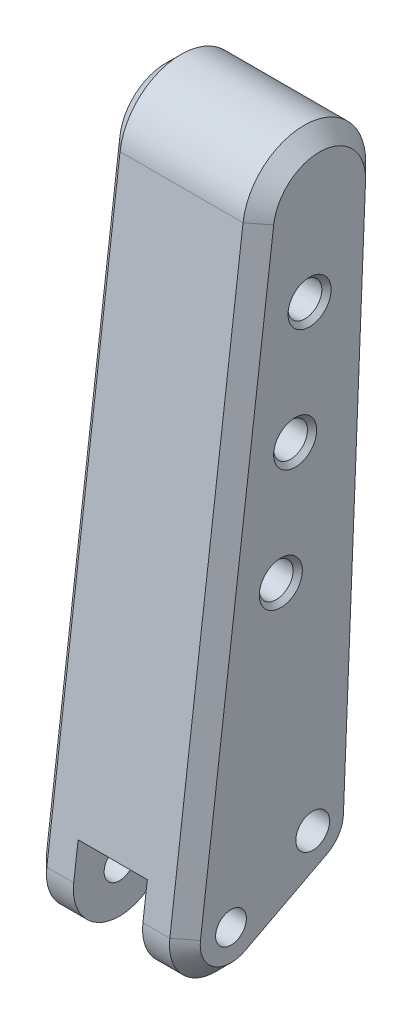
ISO-10303-21;
HEADER;
FILE_DESCRIPTION(('STEP AP214'),'2;1');
FILE_NAME('part.step','',(''),(''),'','','');
FILE_SCHEMA(('AUTOMOTIVE_DESIGN { 1 0 10303 214 1 1 1 1 }'));
ENDSEC;
DATA;
#1=APPLICATION_CONTEXT('core data for automotive mechanical design processes');
#2=APPLICATION_PROTOCOL_DEFINITION('international standard','automotive_design',2000,#1);
#3=PRODUCT_CONTEXT('',#1,'mechanical');
#4=PRODUCT('Part','Part','',(#3));
#5=PRODUCT_RELATED_PRODUCT_CATEGORY('part','',(#4));
#6=PRODUCT_DEFINITION_FORMATION('','',#4);
#7=PRODUCT_DEFINITION_CONTEXT('part definition',#1,'design');
#8=PRODUCT_DEFINITION('design','',#6,#7);
#9=PRODUCT_DEFINITION_SHAPE('','',#8);
#10=(LENGTH_UNIT() NAMED_UNIT(*) SI_UNIT(.MILLI.,.METRE.));
#11=(NAMED_UNIT(*) PLANE_ANGLE_UNIT() SI_UNIT($,.RADIAN.));
#12=(NAMED_UNIT(*) SI_UNIT($,.STERADIAN.) SOLID_ANGLE_UNIT());
#13=UNCERTAINTY_MEASURE_WITH_UNIT(LENGTH_MEASURE(1.E-05),#10,'distance_accuracy_value','');
#14=(GEOMETRIC_REPRESENTATION_CONTEXT(3) GLOBAL_UNCERTAINTY_ASSIGNED_CONTEXT((#13)) GLOBAL_UNIT_ASSIGNED_CONTEXT((#10,
#11,#12)) REPRESENTATION_CONTEXT('',''));
#15=CARTESIAN_POINT('',(0.,0.,0.));
#16=DIRECTION('',(0.,0.,1.));
#17=DIRECTION('',(1.,0.,0.));
#18=AXIS2_PLACEMENT_3D('',#15,#16,#17);
#19=CARTESIAN_POINT('',(-5.,81.8831087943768,0.204953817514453));
#20=DIRECTION('',(-1.,0.,0.));
#21=DIRECTION('',(0.,0.,1.));
#22=AXIS2_PLACEMENT_3D('',#19,#20,#21);
#23=CONICAL_SURFACE('',#22,1.4,0.78539816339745);
#24=CARTESIAN_POINT('',(-5.,81.8831087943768,0.204953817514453));
#25=DIRECTION('',(1.,0.,0.));
#26=DIRECTION('',(0.,0.,-1.));
#27=AXIS2_PLACEMENT_3D('',#24,#25,#26);
#28=CIRCLE('',#27,1.4);
#29=CARTESIAN_POINT('',(-5.,81.8831087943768,-1.19504618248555));
#30=VERTEX_POINT('',#29);
#31=EDGE_CURVE('E154',#30,#30,#28,.T.);
#32=ORIENTED_EDGE('',*,*,#31,.F.);
#33=EDGE_LOOP('',(#32));
#34=FACE_BOUND('',#33,.T.);
#35=CARTESIAN_POINT('',(-4.7,81.8831087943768,0.204953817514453));
#36=DIRECTION('',(-1.,0.,0.));
#37=DIRECTION('',(0.,0.,-1.));
#38=AXIS2_PLACEMENT_3D('',#35,#36,#37);
#39=CIRCLE('',#38,1.1);
#40=CARTESIAN_POINT('',(-4.7,81.8831087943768,-0.895046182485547));
#41=VERTEX_POINT('',#40);
#42=EDGE_CURVE('E11',#41,#41,#39,.T.);
#43=ORIENTED_EDGE('',*,*,#42,.F.);
#44=EDGE_LOOP('',(#43));
#45=FACE_BOUND('',#44,.T.);
#46=ADVANCED_FACE('F16',(#34,#45),#23,.F.);
#47=CARTESIAN_POINT('',(-5.,67.,2.07393017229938));
#48=DIRECTION('',(-1.,0.,0.));
#49=DIRECTION('',(0.,0.,1.));
#50=AXIS2_PLACEMENT_3D('',#47,#48,#49);
#51=CONICAL_SURFACE('',#50,1.4,0.78539816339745);
#52=CARTESIAN_POINT('',(-5.,67.,2.07393017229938));
#53=DIRECTION('',(1.,0.,0.));
#54=DIRECTION('',(0.,0.,-1.));
#55=AXIS2_PLACEMENT_3D('',#52,#53,#54);
#56=CIRCLE('',#55,1.4);
#57=CARTESIAN_POINT('',(-5.,67.,0.673930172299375));
#58=VERTEX_POINT('',#57);
#59=EDGE_CURVE('E159',#58,#58,#56,.T.);
#60=ORIENTED_EDGE('',*,*,#59,.F.);
#61=EDGE_LOOP('',(#60));
#62=FACE_BOUND('',#61,.T.);
#63=CARTESIAN_POINT('',(-4.7,67.,2.07393017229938));
#64=DIRECTION('',(-1.,0.,0.));
#65=DIRECTION('',(0.,0.,-1.));
#66=AXIS2_PLACEMENT_3D('',#63,#64,#65);
#67=CIRCLE('',#66,1.1);
#68=CARTESIAN_POINT('',(-4.7,67.,0.973930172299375));
#69=VERTEX_POINT('',#68);
#70=EDGE_CURVE('E83',#69,#69,#67,.T.);
#71=ORIENTED_EDGE('',*,*,#70,.F.);
#72=EDGE_LOOP('',(#71));
#73=FACE_BOUND('',#72,.T.);
#74=ADVANCED_FACE('F614',(#62,#73),#51,.F.);
#75=CARTESIAN_POINT('',(-5.,74.4415543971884,1.13944199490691));
#76=DIRECTION('',(-1.,0.,0.));
#77=DIRECTION('',(0.,0.,1.));
#78=AXIS2_PLACEMENT_3D('',#75,#76,#77);
#79=CONICAL_SURFACE('',#78,1.4,0.78539816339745);
#80=CARTESIAN_POINT('',(-5.,74.4415543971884,1.13944199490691));
#81=DIRECTION('',(1.,0.,0.));
#82=DIRECTION('',(0.,0.,-1.));
#83=AXIS2_PLACEMENT_3D('',#80,#81,#82);
#84=CIRCLE('',#83,1.4);
#85=CARTESIAN_POINT('',(-5.,74.4415543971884,-0.260558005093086));
#86=VERTEX_POINT('',#85);
#87=EDGE_CURVE('E171',#86,#86,#84,.T.);
#88=ORIENTED_EDGE('',*,*,#87,.F.);
#89=EDGE_LOOP('',(#88));
#90=FACE_BOUND('',#89,.T.);
#91=CARTESIAN_POINT('',(-4.7,74.4415543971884,1.13944199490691));
#92=DIRECTION('',(-1.,0.,0.));
#93=DIRECTION('',(0.,0.,-1.));
#94=AXIS2_PLACEMENT_3D('',#91,#92,#93);
#95=CIRCLE('',#94,1.1);
#96=CARTESIAN_POINT('',(-4.7,74.4415543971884,0.0394419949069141));
#97=VERTEX_POINT('',#96);
#98=EDGE_CURVE('E84',#97,#97,#95,.T.);
#99=ORIENTED_EDGE('',*,*,#98,.F.);
#100=EDGE_LOOP('',(#99));
#101=FACE_BOUND('',#100,.T.);
#102=ADVANCED_FACE('F619',(#90,#101),#79,.F.);
#103=CARTESIAN_POINT('',(5.,81.8831087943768,0.204953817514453));
#104=DIRECTION('',(1.,0.,0.));
#105=DIRECTION('',(0.,0.,-1.));
#106=AXIS2_PLACEMENT_3D('',#103,#104,#105);
#107=CONICAL_SURFACE('',#106,1.4,0.785398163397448);
#108=CARTESIAN_POINT('',(5.,81.8831087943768,0.204953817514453));
#109=DIRECTION('',(-1.,0.,0.));
#110=DIRECTION('',(0.,0.,-1.));
#111=AXIS2_PLACEMENT_3D('',#108,#109,#110);
#112=CIRCLE('',#111,1.4);
#113=CARTESIAN_POINT('',(5.,81.8831087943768,-1.19504618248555));
#114=VERTEX_POINT('',#113);
#115=EDGE_CURVE('E139',#114,#114,#112,.T.);
#116=ORIENTED_EDGE('',*,*,#115,.F.);
#117=EDGE_LOOP('',(#116));
#118=FACE_BOUND('',#117,.T.);
#119=CARTESIAN_POINT('',(4.7,81.8831087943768,0.204953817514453));
#120=DIRECTION('',(1.,0.,0.));
#121=DIRECTION('',(0.,0.,-1.));
#122=AXIS2_PLACEMENT_3D('',#119,#120,#121);
#123=CIRCLE('',#122,1.1);
#124=CARTESIAN_POINT('',(4.7,81.8831087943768,-0.895046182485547));
#125=VERTEX_POINT('',#124);
#126=EDGE_CURVE('E24',#125,#125,#123,.T.);
#127=ORIENTED_EDGE('',*,*,#126,.F.);
#128=EDGE_LOOP('',(#127));
#129=FACE_BOUND('',#128,.T.);
#130=ADVANCED_FACE('F624',(#118,#129),#107,.F.);
#131=CARTESIAN_POINT('',(5.,67.,2.07393017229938));
#132=DIRECTION('',(1.,0.,0.));
#133=DIRECTION('',(0.,0.,-1.));
#134=AXIS2_PLACEMENT_3D('',#131,#132,#133);
#135=CONICAL_SURFACE('',#134,1.4,0.785398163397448);
#136=CARTESIAN_POINT('',(5.,67.,2.07393017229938));
#137=DIRECTION('',(-1.,0.,0.));
#138=DIRECTION('',(0.,0.,-1.));
#139=AXIS2_PLACEMENT_3D('',#136,#137,#138);
#140=CIRCLE('',#139,1.4);
#141=CARTESIAN_POINT('',(5.,67.,0.673930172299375));
#142=VERTEX_POINT('',#141);
#143=EDGE_CURVE('E135',#142,#142,#140,.T.);
#144=ORIENTED_EDGE('',*,*,#143,.F.);
#145=EDGE_LOOP('',(#144));
#146=FACE_BOUND('',#145,.T.);
#147=CARTESIAN_POINT('',(4.7,67.,2.07393017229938));
#148=DIRECTION('',(1.,0.,0.));
#149=DIRECTION('',(0.,0.,-1.));
#150=AXIS2_PLACEMENT_3D('',#147,#148,#149);
#151=CIRCLE('',#150,1.1);
#152=CARTESIAN_POINT('',(4.7,67.,0.973930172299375));
#153=VERTEX_POINT('',#152);
#154=EDGE_CURVE('E79',#153,#153,#151,.T.);
#155=ORIENTED_EDGE('',*,*,#154,.F.);
#156=EDGE_LOOP('',(#155));
#157=FACE_BOUND('',#156,.T.);
#158=ADVANCED_FACE('F632',(#146,#157),#135,.F.);
#159=CARTESIAN_POINT('',(5.,74.4415543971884,1.13944199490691));
#160=DIRECTION('',(1.,0.,0.));
#161=DIRECTION('',(0.,0.,-1.));
#162=AXIS2_PLACEMENT_3D('',#159,#160,#161);
#163=CONICAL_SURFACE('',#162,1.4,0.785398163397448);
#164=CARTESIAN_POINT('',(5.,74.4415543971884,1.13944199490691));
#165=DIRECTION('',(-1.,0.,0.));
#166=DIRECTION('',(0.,0.,-1.));
#167=AXIS2_PLACEMENT_3D('',#164,#165,#166);
#168=CIRCLE('',#167,1.4);
#169=CARTESIAN_POINT('',(5.,74.4415543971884,-0.260558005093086));
#170=VERTEX_POINT('',#169);
#171=EDGE_CURVE('E131',#170,#170,#168,.T.);
#172=ORIENTED_EDGE('',*,*,#171,.F.);
#173=EDGE_LOOP('',(#172));
#174=FACE_BOUND('',#173,.T.);
#175=CARTESIAN_POINT('',(4.7,74.4415543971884,1.13944199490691));
#176=DIRECTION('',(1.,0.,0.));
#177=DIRECTION('',(0.,0.,-1.));
#178=AXIS2_PLACEMENT_3D('',#175,#176,#177);
#179=CIRCLE('',#178,1.1);
#180=CARTESIAN_POINT('',(4.7,74.4415543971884,0.0394419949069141));
#181=VERTEX_POINT('',#180);
#182=EDGE_CURVE('E92',#181,#181,#179,.T.);
#183=ORIENTED_EDGE('',*,*,#182,.F.);
#184=EDGE_LOOP('',(#183));
#185=FACE_BOUND('',#184,.T.);
#186=ADVANCED_FACE('F634',(#174,#185),#163,.F.);
#187=CARTESIAN_POINT('',(-5.,81.8831087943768,0.204953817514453));
#188=DIRECTION('',(1.,0.,0.));
#189=DIRECTION('',(0.,0.,-1.));
#190=AXIS2_PLACEMENT_3D('',#187,#188,#189);
#191=CYLINDRICAL_SURFACE('',#190,1.1);
#192=ORIENTED_EDGE('',*,*,#42,.T.);
#193=EDGE_LOOP('',(#192));
#194=FACE_BOUND('',#193,.T.);
#195=ORIENTED_EDGE('',*,*,#126,.T.);
#196=EDGE_LOOP('',(#195));
#197=FACE_BOUND('',#196,.T.);
#198=ADVANCED_FACE('F637',(#194,#197),#191,.F.);
#199=CARTESIAN_POINT('',(-5.,67.,2.07393017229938));
#200=DIRECTION('',(1.,0.,0.));
#201=DIRECTION('',(0.,0.,-1.));
#202=AXIS2_PLACEMENT_3D('',#199,#200,#201);
#203=CYLINDRICAL_SURFACE('',#202,1.1);
#204=ORIENTED_EDGE('',*,*,#70,.T.);
#205=EDGE_LOOP('',(#204));
#206=FACE_BOUND('',#205,.T.);
#207=ORIENTED_EDGE('',*,*,#154,.T.);
#208=EDGE_LOOP('',(#207));
#209=FACE_BOUND('',#208,.T.);
#210=ADVANCED_FACE('F80',(#206,#209),#203,.F.);
#211=CARTESIAN_POINT('',(-5.,74.4415543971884,1.13944199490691));
#212=DIRECTION('',(1.,0.,0.));
#213=DIRECTION('',(0.,0.,-1.));
#214=AXIS2_PLACEMENT_3D('',#211,#212,#213);
#215=CYLINDRICAL_SURFACE('',#214,1.1);
#216=ORIENTED_EDGE('',*,*,#98,.T.);
#217=EDGE_LOOP('',(#216));
#218=FACE_BOUND('',#217,.T.);
#219=ORIENTED_EDGE('',*,*,#182,.T.);
#220=EDGE_LOOP('',(#219));
#221=FACE_BOUND('',#220,.T.);
#222=ADVANCED_FACE('F641',(#218,#221),#215,.F.);
#223=CARTESIAN_POINT('',(-4.,87.0115299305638,-0.439057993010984));
#224=DIRECTION('',(1.,0.,0.));
#225=DIRECTION('',(0.,0.,-1.));
#226=AXIS2_PLACEMENT_3D('',#223,#224,#225);
#227=CONICAL_SURFACE('',#226,4.,0.785398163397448);
#228=DIRECTION('',(-0.707106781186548,0.0290562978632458,0.70650954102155));
#229=VECTOR('',#228,1.);
#230=CARTESIAN_POINT('',(-4.,86.8471626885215,-4.43567949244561));
#231=LINE('',#230,#229);
#232=CARTESIAN_POINT('',(-4.,86.8471626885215,-4.43567949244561));
#233=VERTEX_POINT('',#232);
#234=CARTESIAN_POINT('',(-5.,86.8882544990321,-3.43652411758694));
#235=VERTEX_POINT('',#234);
#236=EDGE_CURVE('E238',#233,#235,#231,.T.);
#237=ORIENTED_EDGE('',*,*,#236,.T.);
#238=CARTESIAN_POINT('',(-5.,87.0115299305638,-0.439057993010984));
#239=DIRECTION('',(-1.,0.,0.));
#240=DIRECTION('',(0.,0.,-1.));
#241=AXIS2_PLACEMENT_3D('',#238,#239,#240);
#242=CIRCLE('',#241,3.);
#243=CARTESIAN_POINT('',(-5.,87.3853252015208,2.53756376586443));
#244=VERTEX_POINT('',#243);
#245=EDGE_CURVE('E178',#244,#235,#242,.T.);
#246=ORIENTED_EDGE('',*,*,#245,.F.);
#247=DIRECTION('',(0.707106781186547,0.0881043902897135,0.701596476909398));
#248=VECTOR('',#247,1.);
#249=CARTESIAN_POINT('',(-5.,87.3853252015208,2.53756376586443));
#250=LINE('',#249,#248);
#251=CARTESIAN_POINT('',(-4.,87.5099236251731,3.52977101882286));
#252=VERTEX_POINT('',#251);
#253=EDGE_CURVE('E148',#244,#252,#250,.T.);
#254=ORIENTED_EDGE('',*,*,#253,.T.);
#255=CARTESIAN_POINT('',(-4.,87.0115299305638,-0.439057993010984));
#256=DIRECTION('',(1.,0.,0.));
#257=DIRECTION('',(0.,0.,-1.));
#258=AXIS2_PLACEMENT_3D('',#255,#256,#257);
#259=CIRCLE('',#258,4.);
#260=EDGE_CURVE('E307',#233,#252,#259,.T.);
#261=ORIENTED_EDGE('',*,*,#260,.F.);
#262=EDGE_LOOP('',(#237,#246,#254,#261));
#263=FACE_BOUND('',#262,.T.);
#264=ADVANCED_FACE('F645',(#263),#227,.T.);
#265=CARTESIAN_POINT('',(-5.,68.9793389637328,4.84893254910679));
#266=DIRECTION('',(-0.707106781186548,0.0881043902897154,0.701596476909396));
#267=DIRECTION('',(0.123642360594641,0.992326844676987,0.));
#268=AXIS2_PLACEMENT_3D('',#265,#266,#267);
#269=PLANE('',#268);
#270=DIRECTION('',(0.707106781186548,0.0881043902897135,0.701596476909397));
#271=VECTOR('',#270,1.);
#272=CARTESIAN_POINT('',(-5.,49.4652500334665,7.29945355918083));
#273=LINE('',#272,#271);
#274=CARTESIAN_POINT('',(-5.,49.4652500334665,7.29945355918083));
#275=VERTEX_POINT('',#274);
#276=CARTESIAN_POINT('',(-4.,49.5898484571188,8.29166081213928));
#277=VERTEX_POINT('',#276);
#278=EDGE_CURVE('E237',#275,#277,#273,.T.);
#279=ORIENTED_EDGE('',*,*,#278,.T.);
#280=DIRECTION('',(0.,-0.992207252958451,0.124598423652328));
#281=VECTOR('',#280,1.);
#282=CARTESIAN_POINT('',(-4.,49.5898484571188,8.29166081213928));
#283=LINE('',#282,#281);
#284=EDGE_CURVE('E328',#252,#277,#283,.T.);
#285=ORIENTED_EDGE('',*,*,#284,.F.);
#286=ORIENTED_EDGE('',*,*,#253,.F.);
#287=DIRECTION('',(0.,0.992207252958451,-0.124598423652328));
#288=VECTOR('',#287,1.);
#289=CARTESIAN_POINT('',(-5.,87.3853252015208,2.53756376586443));
#290=LINE('',#289,#288);
#291=EDGE_CURVE('E158',#275,#244,#290,.T.);
#292=ORIENTED_EDGE('',*,*,#291,.F.);
#293=EDGE_LOOP('',(#279,#285,#286,#292));
#294=FACE_BOUND('',#293,.T.);
#295=ADVANCED_FACE('F649',(#294),#269,.T.);
#296=CARTESIAN_POINT('',(-4.,69.3619436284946,-3.71657280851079));
#297=DIRECTION('',(0.707106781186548,0.0290562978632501,0.706509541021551));
#298=DIRECTION('',(0.,-0.999155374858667,0.0410918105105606));
#299=AXIS2_PLACEMENT_3D('',#296,#297,#298);
#300=PLANE('',#299);
#301=DIRECTION('',(-0.707106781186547,0.0290562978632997,0.70650954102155));
#302=VECTOR('',#301,1.);
#303=CARTESIAN_POINT('',(-4.,51.8767245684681,-2.99746612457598));
#304=LINE('',#303,#302);
#305=CARTESIAN_POINT('',(-4.,51.8767245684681,-2.99746612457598));
#306=VERTEX_POINT('',#305);
#307=CARTESIAN_POINT('',(-5.,51.9178163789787,-1.99831074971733));
#308=VERTEX_POINT('',#307);
#309=EDGE_CURVE('E233',#306,#308,#304,.T.);
#310=ORIENTED_EDGE('',*,*,#309,.T.);
#311=DIRECTION('',(0.,-0.999155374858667,0.0410918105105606));
#312=VECTOR('',#311,1.);
#313=CARTESIAN_POINT('',(-5.,68.4239866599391,-2.67715253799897));
#314=LINE('',#313,#312);
#315=EDGE_CURVE('E184',#235,#308,#314,.T.);
#316=ORIENTED_EDGE('',*,*,#315,.F.);
#317=ORIENTED_EDGE('',*,*,#236,.F.);
#318=DIRECTION('',(0.,0.999155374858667,-0.0410918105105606));
#319=VECTOR('',#318,1.);
#320=CARTESIAN_POINT('',(-4.,69.3619436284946,-3.71657280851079));
#321=LINE('',#320,#319);
#322=EDGE_CURVE('E119',#306,#233,#321,.T.);
#323=ORIENTED_EDGE('',*,*,#322,.F.);
#324=EDGE_LOOP('',(#310,#316,#317,#323));
#325=FACE_BOUND('',#324,.T.);
#326=ADVANCED_FACE('F652',(#325),#300,.F.);
#327=CARTESIAN_POINT('',(-5.,49.2160531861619,5.31503905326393));
#328=DIRECTION('',(1.,0.,0.));
#329=DIRECTION('',(0.,0.,-1.));
#330=AXIS2_PLACEMENT_3D('',#327,#328,#329);
#331=CONICAL_SURFACE('',#330,2.,0.785398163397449);
#332=DIRECTION('',(0.707106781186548,-0.626383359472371,-0.328091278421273));
#333=VECTOR('',#332,1.);
#334=CARTESIAN_POINT('',(-5.,47.4443735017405,4.38705678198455));
#335=LINE('',#334,#333);
#336=CARTESIAN_POINT('',(-5.,47.4443735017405,4.38705678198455));
#337=VERTEX_POINT('',#336);
#338=CARTESIAN_POINT('',(-4.,46.5585336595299,3.92306564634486));
#339=VERTEX_POINT('',#338);
#340=EDGE_CURVE('E229',#337,#339,#335,.T.);
#341=ORIENTED_EDGE('',*,*,#340,.T.);
#342=CARTESIAN_POINT('',(-4.,49.2160531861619,5.31503905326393));
#343=DIRECTION('',(1.,0.,0.));
#344=DIRECTION('',(0.,0.,-1.));
#345=AXIS2_PLACEMENT_3D('',#342,#343,#344);
#346=CIRCLE('',#345,3.);
#347=EDGE_CURVE('E414',#277,#339,#346,.T.);
#348=ORIENTED_EDGE('',*,*,#347,.F.);
#349=ORIENTED_EDGE('',*,*,#278,.F.);
#350=CARTESIAN_POINT('',(-5.,49.2160531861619,5.31503905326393));
#351=DIRECTION('',(-1.,0.,0.));
#352=DIRECTION('',(0.,0.,-1.));
#353=AXIS2_PLACEMENT_3D('',#350,#351,#352);
#354=CIRCLE('',#353,2.);
#355=EDGE_CURVE('E188',#337,#275,#354,.T.);
#356=ORIENTED_EDGE('',*,*,#355,.F.);
#357=EDGE_LOOP('',(#341,#348,#349,#356));
#358=FACE_BOUND('',#357,.T.);
#359=ADVANCED_FACE('F474',(#358),#331,.T.);
#360=CARTESIAN_POINT('',(-5.,52.,1.58510357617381E-13));
#361=DIRECTION('',(1.,0.,0.));
#362=DIRECTION('',(0.,0.,-1.));
#363=AXIS2_PLACEMENT_3D('',#360,#361,#362);
#364=CONICAL_SURFACE('',#363,2.00000000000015,0.78539816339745);
#365=DIRECTION('',(-0.707106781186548,0.626383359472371,0.328091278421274));
#366=VECTOR('',#365,1.);
#367=CARTESIAN_POINT('',(-4.,49.342480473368,-1.39197340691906));
#368=LINE('',#367,#366);
#369=CARTESIAN_POINT('',(-4.,49.342480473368,-1.39197340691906));
#370=VERTEX_POINT('',#369);
#371=CARTESIAN_POINT('',(-5.,50.2283203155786,-0.927982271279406));
#372=VERTEX_POINT('',#371);
#373=EDGE_CURVE('E230',#370,#372,#368,.T.);
#374=ORIENTED_EDGE('',*,*,#373,.T.);
#375=CARTESIAN_POINT('',(-5.,52.,1.58510357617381E-13));
#376=DIRECTION('',(-1.,0.,0.));
#377=DIRECTION('',(0.,0.,-1.));
#378=AXIS2_PLACEMENT_3D('',#375,#376,#377);
#379=CIRCLE('',#378,2.00000000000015);
#380=EDGE_CURVE('E179',#308,#372,#379,.T.);
#381=ORIENTED_EDGE('',*,*,#380,.F.);
#382=ORIENTED_EDGE('',*,*,#309,.F.);
#383=CARTESIAN_POINT('',(-4.,52.,1.58510357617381E-13));
#384=DIRECTION('',(1.,0.,0.));
#385=DIRECTION('',(0.,0.,-1.));
#386=AXIS2_PLACEMENT_3D('',#383,#384,#385);
#387=CIRCLE('',#386,3.00000000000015);
#388=EDGE_CURVE('E105',#370,#306,#387,.T.);
#389=ORIENTED_EDGE('',*,*,#388,.F.);
#390=EDGE_LOOP('',(#374,#381,#382,#389));
#391=FACE_BOUND('',#390,.T.);
#392=ADVANCED_FACE('F655',(#391),#364,.T.);
#393=CARTESIAN_POINT('',(-4.,47.950507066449,1.26554611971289));
#394=DIRECTION('',(0.707106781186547,0.626383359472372,0.328091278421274));
#395=DIRECTION('',(0.,0.463991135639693,-0.88583984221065));
#396=AXIS2_PLACEMENT_3D('',#393,#394,#395);
#397=PLANE('',#396);
#398=ORIENTED_EDGE('',*,*,#340,.F.);
#399=DIRECTION('',(0.,-0.463991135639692,0.88583984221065));
#400=VECTOR('',#399,1.);
#401=CARTESIAN_POINT('',(-5.,53.0085100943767,-6.23584849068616));
#402=LINE('',#401,#400);
#403=EDGE_CURVE('E183',#372,#337,#402,.T.);
#404=ORIENTED_EDGE('',*,*,#403,.F.);
#405=ORIENTED_EDGE('',*,*,#373,.F.);
#406=DIRECTION('',(0.,0.463991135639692,-0.88583984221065));
#407=VECTOR('',#406,1.);
#408=CARTESIAN_POINT('',(-4.,47.950507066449,1.26554611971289));
#409=LINE('',#408,#407);
#410=EDGE_CURVE('E420',#339,#370,#409,.T.);
#411=ORIENTED_EDGE('',*,*,#410,.F.);
#412=EDGE_LOOP('',(#398,#404,#405,#411));
#413=FACE_BOUND('',#412,.T.);
#414=ADVANCED_FACE('F483',(#413),#397,.F.);
#415=CARTESIAN_POINT('',(5.,87.0115299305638,-0.439057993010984));
#416=DIRECTION('',(-1.,0.,0.));
#417=DIRECTION('',(0.,0.,1.));
#418=AXIS2_PLACEMENT_3D('',#415,#416,#417);
#419=CONICAL_SURFACE('',#418,3.,0.785398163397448);
#420=DIRECTION('',(-0.707106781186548,-0.0290562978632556,-0.70650954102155));
#421=VECTOR('',#420,1.);
#422=CARTESIAN_POINT('',(5.,86.8882544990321,-3.43652411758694));
#423=LINE('',#422,#421);
#424=CARTESIAN_POINT('',(5.,86.8882544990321,-3.43652411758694));
#425=VERTEX_POINT('',#424);
#426=CARTESIAN_POINT('',(4.,86.8471626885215,-4.43567949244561));
#427=VERTEX_POINT('',#426);
#428=EDGE_CURVE('E221',#425,#427,#423,.T.);
#429=ORIENTED_EDGE('',*,*,#428,.T.);
#430=CARTESIAN_POINT('',(4.,87.0115299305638,-0.439057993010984));
#431=DIRECTION('',(-1.,0.,0.));
#432=DIRECTION('',(0.,0.,-1.));
#433=AXIS2_PLACEMENT_3D('',#430,#431,#432);
#434=CIRCLE('',#433,4.);
#435=CARTESIAN_POINT('',(4.,87.5099236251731,3.52977101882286));
#436=VERTEX_POINT('',#435);
#437=EDGE_CURVE('E311',#436,#427,#434,.T.);
#438=ORIENTED_EDGE('',*,*,#437,.F.);
#439=DIRECTION('',(0.707106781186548,-0.0881043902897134,-0.701596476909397));
#440=VECTOR('',#439,1.);
#441=CARTESIAN_POINT('',(4.,87.5099236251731,3.52977101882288));
#442=LINE('',#441,#440);
#443=CARTESIAN_POINT('',(5.,87.3853252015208,2.53756376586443));
#444=VERTEX_POINT('',#443);
#445=EDGE_CURVE('E225',#436,#444,#442,.T.);
#446=ORIENTED_EDGE('',*,*,#445,.T.);
#447=CARTESIAN_POINT('',(5.,87.0115299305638,-0.439057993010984));
#448=DIRECTION('',(1.,0.,0.));
#449=DIRECTION('',(0.,0.,-1.));
#450=AXIS2_PLACEMENT_3D('',#447,#448,#449);
#451=CIRCLE('',#450,3.);
#452=EDGE_CURVE('E144',#425,#444,#451,.T.);
#453=ORIENTED_EDGE('',*,*,#452,.F.);
#454=EDGE_LOOP('',(#429,#438,#446,#453));
#455=FACE_BOUND('',#454,.T.);
#456=ADVANCED_FACE('F661',(#455),#419,.T.);
#457=CARTESIAN_POINT('',(4.,50.7303826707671,8.1484359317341));
#458=DIRECTION('',(-0.707106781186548,-0.0881043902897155,-0.701596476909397));
#459=DIRECTION('',(-0.704335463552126,0.,0.709867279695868));
#460=AXIS2_PLACEMENT_3D('',#457,#458,#459);
#461=PLANE('',#460);
#462=DIRECTION('',(0.707106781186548,-0.0881043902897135,-0.701596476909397));
#463=VECTOR('',#462,1.);
#464=CARTESIAN_POINT('',(4.,49.5898484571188,8.29166081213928));
#465=LINE('',#464,#463);
#466=CARTESIAN_POINT('',(4.,49.5898484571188,8.29166081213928));
#467=VERTEX_POINT('',#466);
#468=CARTESIAN_POINT('',(5.,49.4652500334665,7.29945355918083));
#469=VERTEX_POINT('',#468);
#470=EDGE_CURVE('E217',#467,#469,#465,.T.);
#471=ORIENTED_EDGE('',*,*,#470,.T.);
#472=DIRECTION('',(0.,-0.992207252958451,0.124598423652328));
#473=VECTOR('',#472,1.);
#474=CARTESIAN_POINT('',(5.,68.9793389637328,4.84893254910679));
#475=LINE('',#474,#473);
#476=EDGE_CURVE('E149',#444,#469,#475,.T.);
#477=ORIENTED_EDGE('',*,*,#476,.F.);
#478=ORIENTED_EDGE('',*,*,#445,.F.);
#479=DIRECTION('',(0.,0.992207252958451,-0.124598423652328));
#480=VECTOR('',#479,1.);
#481=CARTESIAN_POINT('',(4.,50.7303826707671,8.1484359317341));
#482=LINE('',#481,#480);
#483=EDGE_CURVE('E306',#467,#436,#482,.T.);
#484=ORIENTED_EDGE('',*,*,#483,.F.);
#485=EDGE_LOOP('',(#471,#477,#478,#484));
#486=FACE_BOUND('',#485,.T.);
#487=ADVANCED_FACE('F664',(#486),#461,.F.);
#488=CARTESIAN_POINT('',(5.,68.4239866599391,-2.67715253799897));
#489=DIRECTION('',(0.707106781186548,-0.0290562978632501,-0.706509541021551));
#490=DIRECTION('',(0.,-0.999155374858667,0.0410918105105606));
#491=AXIS2_PLACEMENT_3D('',#488,#489,#490);
#492=PLANE('',#491);
#493=DIRECTION('',(-0.707106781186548,-0.0290562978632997,-0.706509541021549));
#494=VECTOR('',#493,1.);
#495=CARTESIAN_POINT('',(5.,51.9178163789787,-1.99831074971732));
#496=LINE('',#495,#494);
#497=CARTESIAN_POINT('',(5.,51.9178163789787,-1.99831074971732));
#498=VERTEX_POINT('',#497);
#499=CARTESIAN_POINT('',(4.,51.8767245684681,-2.99746612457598));
#500=VERTEX_POINT('',#499);
#501=EDGE_CURVE('E213',#498,#500,#496,.T.);
#502=ORIENTED_EDGE('',*,*,#501,.T.);
#503=DIRECTION('',(0.,-0.999155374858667,0.0410918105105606));
#504=VECTOR('',#503,1.);
#505=CARTESIAN_POINT('',(4.,51.8767245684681,-2.99746612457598));
#506=LINE('',#505,#504);
#507=EDGE_CURVE('E112',#427,#500,#506,.T.);
#508=ORIENTED_EDGE('',*,*,#507,.F.);
#509=ORIENTED_EDGE('',*,*,#428,.F.);
#510=DIRECTION('',(0.,0.999155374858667,-0.0410918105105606));
#511=VECTOR('',#510,1.);
#512=CARTESIAN_POINT('',(5.,86.8882544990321,-3.43652411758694));
#513=LINE('',#512,#511);
#514=EDGE_CURVE('E140',#498,#425,#513,.T.);
#515=ORIENTED_EDGE('',*,*,#514,.F.);
#516=EDGE_LOOP('',(#502,#508,#509,#515));
#517=FACE_BOUND('',#516,.T.);
#518=ADVANCED_FACE('F668',(#517),#492,.T.);
#519=CARTESIAN_POINT('',(4.,49.2160531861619,5.31503905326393));
#520=DIRECTION('',(-1.,0.,0.));
#521=DIRECTION('',(0.,0.,1.));
#522=AXIS2_PLACEMENT_3D('',#519,#520,#521);
#523=CONICAL_SURFACE('',#522,3.,0.785398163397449);
#524=DIRECTION('',(0.707106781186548,0.626383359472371,0.328091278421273));
#525=VECTOR('',#524,1.);
#526=CARTESIAN_POINT('',(4.,46.5585336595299,3.92306564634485));
#527=LINE('',#526,#525);
#528=CARTESIAN_POINT('',(4.,46.5585336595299,3.92306564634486));
#529=VERTEX_POINT('',#528);
#530=CARTESIAN_POINT('',(5.,47.4443735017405,4.38705678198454));
#531=VERTEX_POINT('',#530);
#532=EDGE_CURVE('E113',#529,#531,#527,.T.);
#533=ORIENTED_EDGE('',*,*,#532,.T.);
#534=CARTESIAN_POINT('',(5.,49.2160531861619,5.31503905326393));
#535=DIRECTION('',(1.,0.,0.));
#536=DIRECTION('',(0.,0.,-1.));
#537=AXIS2_PLACEMENT_3D('',#534,#535,#536);
#538=CIRCLE('',#537,2.);
#539=EDGE_CURVE('E153',#469,#531,#538,.T.);
#540=ORIENTED_EDGE('',*,*,#539,.F.);
#541=ORIENTED_EDGE('',*,*,#470,.F.);
#542=CARTESIAN_POINT('',(4.,49.2160531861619,5.31503905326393));
#543=DIRECTION('',(-1.,0.,0.));
#544=DIRECTION('',(0.,0.,-1.));
#545=AXIS2_PLACEMENT_3D('',#542,#543,#544);
#546=CIRCLE('',#545,3.);
#547=EDGE_CURVE('E265',#529,#467,#546,.T.);
#548=ORIENTED_EDGE('',*,*,#547,.F.);
#549=EDGE_LOOP('',(#533,#540,#541,#548));
#550=FACE_BOUND('',#549,.T.);
#551=ADVANCED_FACE('F673',(#550),#523,.T.);
#552=CARTESIAN_POINT('',(4.,52.,1.58510357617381E-13));
#553=DIRECTION('',(-1.,0.,0.));
#554=DIRECTION('',(0.,0.,1.));
#555=AXIS2_PLACEMENT_3D('',#552,#553,#554);
#556=CONICAL_SURFACE('',#555,3.00000000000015,0.785398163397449);
#557=DIRECTION('',(-0.707106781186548,-0.626383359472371,-0.328091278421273));
#558=VECTOR('',#557,1.);
#559=CARTESIAN_POINT('',(5.,50.2283203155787,-0.927982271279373));
#560=LINE('',#559,#558);
#561=CARTESIAN_POINT('',(5.,50.2283203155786,-0.927982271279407));
#562=VERTEX_POINT('',#561);
#563=CARTESIAN_POINT('',(4.,49.342480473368,-1.39197340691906));
#564=VERTEX_POINT('',#563);
#565=EDGE_CURVE('E117',#562,#564,#560,.T.);
#566=ORIENTED_EDGE('',*,*,#565,.T.);
#567=CARTESIAN_POINT('',(4.,52.,1.58510357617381E-13));
#568=DIRECTION('',(-1.,0.,0.));
#569=DIRECTION('',(0.,0.,-1.));
#570=AXIS2_PLACEMENT_3D('',#567,#568,#569);
#571=CIRCLE('',#570,3.00000000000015);
#572=EDGE_CURVE('E95',#500,#564,#571,.T.);
#573=ORIENTED_EDGE('',*,*,#572,.F.);
#574=ORIENTED_EDGE('',*,*,#501,.F.);
#575=CARTESIAN_POINT('',(5.,52.,1.58510357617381E-13));
#576=DIRECTION('',(1.,0.,0.));
#577=DIRECTION('',(0.,0.,-1.));
#578=AXIS2_PLACEMENT_3D('',#575,#576,#577);
#579=CIRCLE('',#578,2.00000000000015);
#580=EDGE_CURVE('E167',#562,#498,#579,.T.);
#581=ORIENTED_EDGE('',*,*,#580,.F.);
#582=EDGE_LOOP('',(#566,#573,#574,#581));
#583=FACE_BOUND('',#582,.T.);
#584=ADVANCED_FACE('F676',(#583),#556,.T.);
#585=CARTESIAN_POINT('',(5.,53.0085100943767,-6.23584849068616));
#586=DIRECTION('',(0.707106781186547,-0.626383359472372,-0.328091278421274));
#587=DIRECTION('',(0.,0.463991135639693,-0.88583984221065));
#588=AXIS2_PLACEMENT_3D('',#585,#586,#587);
#589=PLANE('',#588);
#590=ORIENTED_EDGE('',*,*,#532,.F.);
#591=DIRECTION('',(0.,-0.463991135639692,0.88583984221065));
#592=VECTOR('',#591,1.);
#593=CARTESIAN_POINT('',(4.,46.5585336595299,3.92306564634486));
#594=LINE('',#593,#592);
#595=EDGE_CURVE('E273',#564,#529,#594,.T.);
#596=ORIENTED_EDGE('',*,*,#595,.F.);
#597=ORIENTED_EDGE('',*,*,#565,.F.);
#598=DIRECTION('',(0.,0.463991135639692,-0.88583984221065));
#599=VECTOR('',#598,1.);
#600=CARTESIAN_POINT('',(5.,50.2283203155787,-0.927982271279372));
#601=LINE('',#600,#599);
#602=EDGE_CURVE('E163',#531,#562,#601,.T.);
#603=ORIENTED_EDGE('',*,*,#602,.F.);
#604=EDGE_LOOP('',(#590,#596,#597,#603));
#605=FACE_BOUND('',#604,.T.);
#606=ADVANCED_FACE('F680',(#605),#589,.T.);
#607=CARTESIAN_POINT('',(2.25,68.6137915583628,1.93799053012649));
#608=DIRECTION('',(1.,0.,0.));
#609=DIRECTION('',(0.,1.,0.));
#610=AXIS2_PLACEMENT_3D('',#607,#608,#609);
#611=PLANE('',#610);
#612=CARTESIAN_POINT('',(2.25,49.2160531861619,5.31503905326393));
#613=DIRECTION('',(1.,0.,0.));
#614=DIRECTION('',(0.,0.,-1.));
#615=AXIS2_PLACEMENT_3D('',#612,#613,#614);
#616=CIRCLE('',#615,1.);
#617=CARTESIAN_POINT('',(2.25,49.2160531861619,4.31503905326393));
#618=VERTEX_POINT('',#617);
#619=EDGE_CURVE('E123',#618,#618,#616,.T.);
#620=ORIENTED_EDGE('',*,*,#619,.T.);
#621=EDGE_LOOP('',(#620));
#622=FACE_BOUND('',#621,.T.);
#623=DIRECTION('',(0.,-0.18266058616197,-0.983176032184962));
#624=VECTOR('',#623,1.);
#625=CARTESIAN_POINT('',(2.25,52.5346862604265,2.87796468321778));
#626=LINE('',#625,#624);
#627=CARTESIAN_POINT('',(2.25,53.0640543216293,5.72730400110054));
#628=VERTEX_POINT('',#627);
#629=CARTESIAN_POINT('',(2.25,52.2009266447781,1.08149363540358));
#630=VERTEX_POINT('',#629);
#631=EDGE_CURVE('E192',#628,#630,#626,.T.);
#632=ORIENTED_EDGE('',*,*,#631,.T.);
#633=CARTESIAN_POINT('',(2.25,52.,1.20129600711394E-13));
#634=DIRECTION('',(1.,0.,0.));
#635=DIRECTION('',(0.,0.,-1.));
#636=AXIS2_PLACEMENT_3D('',#633,#634,#635);
#637=CIRCLE('',#636,1.1);
#638=CARTESIAN_POINT('',(2.25,51.7990733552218,-1.08149363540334));
#639=VERTEX_POINT('',#638);
#640=EDGE_CURVE('E289',#630,#639,#637,.T.);
#641=ORIENTED_EDGE('',*,*,#640,.T.);
#642=DIRECTION('',(0.,-0.182660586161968,-0.983176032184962));
#643=VECTOR('',#642,1.);
#644=CARTESIAN_POINT('',(2.25,51.634678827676,-1.96635206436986));
#645=LINE('',#644,#643);
#646=CARTESIAN_POINT('',(2.25,51.452018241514,-2.94952809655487));
#647=VERTEX_POINT('',#646);
#648=EDGE_CURVE('E379',#639,#647,#645,.T.);
#649=ORIENTED_EDGE('',*,*,#648,.T.);
#650=CARTESIAN_POINT('',(2.25,52.,0.));
#651=DIRECTION('',(-1.,0.,0.));
#652=DIRECTION('',(0.,0.,-1.));
#653=AXIS2_PLACEMENT_3D('',#650,#651,#652);
#654=CIRCLE('',#653,3.);
#655=CARTESIAN_POINT('',(2.25,49.342480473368,-1.39197340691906));
#656=VERTEX_POINT('',#655);
#657=EDGE_CURVE('E97',#647,#656,#654,.T.);
#658=ORIENTED_EDGE('',*,*,#657,.T.);
#659=DIRECTION('',(0.,0.463991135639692,-0.88583984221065));
#660=VECTOR('',#659,1.);
#661=CARTESIAN_POINT('',(2.25,47.950507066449,1.26554611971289));
#662=LINE('',#661,#660);
#663=CARTESIAN_POINT('',(2.25,46.5585336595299,3.92306564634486));
#664=VERTEX_POINT('',#663);
#665=EDGE_CURVE('E276',#664,#656,#662,.T.);
#666=ORIENTED_EDGE('',*,*,#665,.F.);
#667=CARTESIAN_POINT('',(2.25,49.2160531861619,5.31503905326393));
#668=DIRECTION('',(-1.,0.,0.));
#669=DIRECTION('',(0.,0.,-1.));
#670=AXIS2_PLACEMENT_3D('',#667,#668,#669);
#671=CIRCLE('',#670,3.);
#672=CARTESIAN_POINT('',(2.25,49.5898484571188,8.29166081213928));
#673=VERTEX_POINT('',#672);
#674=EDGE_CURVE('E268',#664,#673,#671,.T.);
#675=ORIENTED_EDGE('',*,*,#674,.T.);
#676=DIRECTION('',(0.,0.992207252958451,-0.124598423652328));
#677=VECTOR('',#676,1.);
#678=CARTESIAN_POINT('',(2.25,50.7303826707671,8.1484359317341));
#679=LINE('',#678,#677);
#680=CARTESIAN_POINT('',(2.25,51.8709168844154,8.00521105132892));
#681=VERTEX_POINT('',#680);
#682=EDGE_CURVE('E340',#673,#681,#679,.T.);
#683=ORIENTED_EDGE('',*,*,#682,.T.);
#684=DIRECTION('',(0.,0.463991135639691,-0.885839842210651));
#685=VECTOR('',#684,1.);
#686=CARTESIAN_POINT('',(2.25,52.4674856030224,6.86625752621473));
#687=LINE('',#686,#685);
#688=EDGE_CURVE('E204',#681,#628,#687,.T.);
#689=ORIENTED_EDGE('',*,*,#688,.T.);
#690=EDGE_LOOP('',(#632,#641,#649,#658,#666,#675,#683,#689));
#691=FACE_BOUND('',#690,.T.);
#692=ADVANCED_FACE('F376',(#622,#691),#611,.F.);
#693=CARTESIAN_POINT('',(-2.25,68.6137915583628,1.93799053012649));
#694=DIRECTION('',(1.,0.,0.));
#695=DIRECTION('',(0.,1.,0.));
#696=AXIS2_PLACEMENT_3D('',#693,#694,#695);
#697=PLANE('',#696);
#698=CARTESIAN_POINT('',(-2.25,49.2160531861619,5.31503905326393));
#699=DIRECTION('',(1.,0.,0.));
#700=DIRECTION('',(0.,0.,-1.));
#701=AXIS2_PLACEMENT_3D('',#698,#699,#700);
#702=CIRCLE('',#701,1.);
#703=CARTESIAN_POINT('',(-2.25,49.2160531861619,4.31503905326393));
#704=VERTEX_POINT('',#703);
#705=EDGE_CURVE('E293',#704,#704,#702,.T.);
#706=ORIENTED_EDGE('',*,*,#705,.F.);
#707=EDGE_LOOP('',(#706));
#708=FACE_BOUND('',#707,.T.);
#709=DIRECTION('',(0.,-0.18266058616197,-0.983176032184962));
#710=VECTOR('',#709,1.);
#711=CARTESIAN_POINT('',(-2.25,52.5346862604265,2.87796468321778));
#712=LINE('',#711,#710);
#713=CARTESIAN_POINT('',(-2.25,53.0640543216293,5.72730400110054));
#714=VERTEX_POINT('',#713);
#715=CARTESIAN_POINT('',(-2.25,52.2009266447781,1.08149363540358));
#716=VERTEX_POINT('',#715);
#717=EDGE_CURVE('E200',#714,#716,#712,.T.);
#718=ORIENTED_EDGE('',*,*,#717,.F.);
#719=DIRECTION('',(0.,0.463991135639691,-0.885839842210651));
#720=VECTOR('',#719,1.);
#721=CARTESIAN_POINT('',(-2.25,52.4674856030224,6.86625752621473));
#722=LINE('',#721,#720);
#723=CARTESIAN_POINT('',(-2.25,51.8709168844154,8.00521105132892));
#724=VERTEX_POINT('',#723);
#725=EDGE_CURVE('E209',#724,#714,#722,.T.);
#726=ORIENTED_EDGE('',*,*,#725,.F.);
#727=DIRECTION('',(0.,0.992207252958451,-0.124598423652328));
#728=VECTOR('',#727,1.);
#729=CARTESIAN_POINT('',(-2.25,50.7303826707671,8.1484359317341));
#730=LINE('',#729,#728);
#731=CARTESIAN_POINT('',(-2.25,49.5898484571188,8.29166081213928));
#732=VERTEX_POINT('',#731);
#733=EDGE_CURVE('E334',#732,#724,#730,.T.);
#734=ORIENTED_EDGE('',*,*,#733,.F.);
#735=CARTESIAN_POINT('',(-2.25,49.2160531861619,5.31503905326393));
#736=DIRECTION('',(-1.,0.,0.));
#737=DIRECTION('',(0.,0.,-1.));
#738=AXIS2_PLACEMENT_3D('',#735,#736,#737);
#739=CIRCLE('',#738,3.);
#740=CARTESIAN_POINT('',(-2.25,46.5585336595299,3.92306564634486));
#741=VERTEX_POINT('',#740);
#742=EDGE_CURVE('E427',#741,#732,#739,.T.);
#743=ORIENTED_EDGE('',*,*,#742,.F.);
#744=DIRECTION('',(0.,0.463991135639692,-0.88583984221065));
#745=VECTOR('',#744,1.);
#746=CARTESIAN_POINT('',(-2.25,47.950507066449,1.26554611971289));
#747=LINE('',#746,#745);
#748=CARTESIAN_POINT('',(-2.25,49.342480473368,-1.39197340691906));
#749=VERTEX_POINT('',#748);
#750=EDGE_CURVE('E415',#741,#749,#747,.T.);
#751=ORIENTED_EDGE('',*,*,#750,.T.);
#752=CARTESIAN_POINT('',(-2.25,52.,0.));
#753=DIRECTION('',(-1.,0.,0.));
#754=DIRECTION('',(0.,0.,-1.));
#755=AXIS2_PLACEMENT_3D('',#752,#753,#754);
#756=CIRCLE('',#755,3.);
#757=CARTESIAN_POINT('',(-2.25,51.452018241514,-2.94952809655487));
#758=VERTEX_POINT('',#757);
#759=EDGE_CURVE('E101',#758,#749,#756,.T.);
#760=ORIENTED_EDGE('',*,*,#759,.F.);
#761=DIRECTION('',(0.,-0.182660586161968,-0.983176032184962));
#762=VECTOR('',#761,1.);
#763=CARTESIAN_POINT('',(-2.25,51.634678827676,-1.96635206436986));
#764=LINE('',#763,#762);
#765=CARTESIAN_POINT('',(-2.25,51.7990733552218,-1.08149363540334));
#766=VERTEX_POINT('',#765);
#767=EDGE_CURVE('E118',#766,#758,#764,.T.);
#768=ORIENTED_EDGE('',*,*,#767,.F.);
#769=CARTESIAN_POINT('',(-2.25,52.,1.20129600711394E-13));
#770=DIRECTION('',(1.,0.,0.));
#771=DIRECTION('',(0.,0.,-1.));
#772=AXIS2_PLACEMENT_3D('',#769,#770,#771);
#773=CIRCLE('',#772,1.1);
#774=EDGE_CURVE('E358',#716,#766,#773,.T.);
#775=ORIENTED_EDGE('',*,*,#774,.F.);
#776=EDGE_LOOP('',(#718,#726,#734,#743,#751,#760,#768,#775));
#777=FACE_BOUND('',#776,.T.);
#778=ADVANCED_FACE('F492',(#708,#777),#697,.T.);
#779=CARTESIAN_POINT('',(-2.25,51.634678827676,-1.96635206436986));
#780=DIRECTION('',(0.,-0.983176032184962,0.182660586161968));
#781=DIRECTION('',(-1.,0.,0.));
#782=AXIS2_PLACEMENT_3D('',#779,#780,#781);
#783=PLANE('',#782);
#784=ORIENTED_EDGE('',*,*,#648,.F.);
#785=DIRECTION('',(1.,0.,0.));
#786=VECTOR('',#785,1.);
#787=CARTESIAN_POINT('',(5.,51.7990733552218,-1.08149363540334));
#788=LINE('',#787,#786);
#789=EDGE_CURVE('E361',#766,#639,#788,.T.);
#790=ORIENTED_EDGE('',*,*,#789,.F.);
#791=ORIENTED_EDGE('',*,*,#767,.T.);
#792=DIRECTION('',(1.,0.,0.));
#793=VECTOR('',#792,1.);
#794=CARTESIAN_POINT('',(-2.25,51.452018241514,-2.94952809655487));
#795=LINE('',#794,#793);
#796=EDGE_CURVE('E100',#758,#647,#795,.T.);
#797=ORIENTED_EDGE('',*,*,#796,.T.);
#798=EDGE_LOOP('',(#784,#790,#791,#797));
#799=FACE_BOUND('',#798,.T.);
#800=ADVANCED_FACE('F687',(#799),#783,.T.);
#801=CARTESIAN_POINT('',(-2.25,52.4674856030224,6.86625752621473));
#802=DIRECTION('',(0.,-0.885839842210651,-0.463991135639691));
#803=DIRECTION('',(0.,0.463991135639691,-0.885839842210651));
#804=AXIS2_PLACEMENT_3D('',#801,#802,#803);
#805=PLANE('',#804);
#806=ORIENTED_EDGE('',*,*,#688,.F.);
#807=DIRECTION('',(1.,0.,0.));
#808=VECTOR('',#807,1.);
#809=CARTESIAN_POINT('',(-2.25,51.8709168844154,8.00521105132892));
#810=LINE('',#809,#808);
#811=EDGE_CURVE('E337',#724,#681,#810,.T.);
#812=ORIENTED_EDGE('',*,*,#811,.F.);
#813=ORIENTED_EDGE('',*,*,#725,.T.);
#814=DIRECTION('',(1.,0.,0.));
#815=VECTOR('',#814,1.);
#816=CARTESIAN_POINT('',(-2.25,53.0640543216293,5.72730400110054));
#817=LINE('',#816,#815);
#818=EDGE_CURVE('E196',#714,#628,#817,.T.);
#819=ORIENTED_EDGE('',*,*,#818,.T.);
#820=EDGE_LOOP('',(#806,#812,#813,#819));
#821=FACE_BOUND('',#820,.T.);
#822=ADVANCED_FACE('F694',(#821),#805,.T.);
#823=CARTESIAN_POINT('',(-2.25,52.5346862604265,2.87796468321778));
#824=DIRECTION('',(0.,-0.983176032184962,0.18266058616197));
#825=DIRECTION('',(-1.,0.,0.));
#826=AXIS2_PLACEMENT_3D('',#823,#824,#825);
#827=PLANE('',#826);
#828=ORIENTED_EDGE('',*,*,#631,.F.);
#829=ORIENTED_EDGE('',*,*,#818,.F.);
#830=ORIENTED_EDGE('',*,*,#717,.T.);
#831=DIRECTION('',(1.,0.,0.));
#832=VECTOR('',#831,1.);
#833=CARTESIAN_POINT('',(5.,52.2009266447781,1.08149363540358));
#834=LINE('',#833,#832);
#835=EDGE_CURVE('E362',#716,#630,#834,.T.);
#836=ORIENTED_EDGE('',*,*,#835,.T.);
#837=EDGE_LOOP('',(#828,#829,#830,#836));
#838=FACE_BOUND('',#837,.T.);
#839=ADVANCED_FACE('F394',(#838),#827,.T.);
#840=CARTESIAN_POINT('',(-5.,68.6137915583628,1.93799053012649));
#841=DIRECTION('',(1.,0.,0.));
#842=DIRECTION('',(0.,1.,0.));
#843=AXIS2_PLACEMENT_3D('',#840,#841,#842);
#844=PLANE('',#843);
#845=CARTESIAN_POINT('',(-5.,49.2160531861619,5.31503905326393));
#846=DIRECTION('',(1.,0.,0.));
#847=DIRECTION('',(0.,0.,-1.));
#848=AXIS2_PLACEMENT_3D('',#845,#846,#847);
#849=CIRCLE('',#848,1.);
#850=CARTESIAN_POINT('',(-5.,49.2160531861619,4.31503905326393));
#851=VERTEX_POINT('',#850);
#852=EDGE_CURVE('E290',#851,#851,#849,.T.);
#853=ORIENTED_EDGE('',*,*,#852,.T.);
#854=EDGE_LOOP('',(#853));
#855=FACE_BOUND('',#854,.T.);
#856=CARTESIAN_POINT('',(-5.,52.,1.20129600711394E-13));
#857=DIRECTION('',(1.,0.,0.));
#858=DIRECTION('',(0.,0.,-1.));
#859=AXIS2_PLACEMENT_3D('',#856,#857,#858);
#860=CIRCLE('',#859,1.1);
#861=CARTESIAN_POINT('',(-5.,52.,-1.09999999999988));
#862=VERTEX_POINT('',#861);
#863=EDGE_CURVE('E356',#862,#862,#860,.T.);
#864=ORIENTED_EDGE('',*,*,#863,.T.);
#865=EDGE_LOOP('',(#864));
#866=FACE_BOUND('',#865,.T.);
#867=ORIENTED_EDGE('',*,*,#291,.T.);
#868=ORIENTED_EDGE('',*,*,#245,.T.);
#869=ORIENTED_EDGE('',*,*,#315,.T.);
#870=ORIENTED_EDGE('',*,*,#380,.T.);
#871=ORIENTED_EDGE('',*,*,#403,.T.);
#872=ORIENTED_EDGE('',*,*,#355,.T.);
#873=EDGE_LOOP('',(#867,#868,#869,#870,#871,#872));
#874=FACE_BOUND('',#873,.T.);
#875=ORIENTED_EDGE('',*,*,#31,.T.);
#876=EDGE_LOOP('',(#875));
#877=FACE_BOUND('',#876,.T.);
#878=ORIENTED_EDGE('',*,*,#59,.T.);
#879=EDGE_LOOP('',(#878));
#880=FACE_BOUND('',#879,.T.);
#881=ORIENTED_EDGE('',*,*,#87,.T.);
#882=EDGE_LOOP('',(#881));
#883=FACE_BOUND('',#882,.T.);
#884=ADVANCED_FACE('F609',(#855,#866,#874,#877,#880,#883),#844,.F.);
#885=CARTESIAN_POINT('',(5.,68.6137915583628,1.93799053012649));
#886=DIRECTION('',(1.,0.,0.));
#887=DIRECTION('',(0.,1.,0.));
#888=AXIS2_PLACEMENT_3D('',#885,#886,#887);
#889=PLANE('',#888);
#890=CARTESIAN_POINT('',(5.,49.2160531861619,5.31503905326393));
#891=DIRECTION('',(1.,0.,0.));
#892=DIRECTION('',(0.,0.,-1.));
#893=AXIS2_PLACEMENT_3D('',#890,#891,#892);
#894=CIRCLE('',#893,1.);
#895=CARTESIAN_POINT('',(5.,49.2160531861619,4.31503905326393));
#896=VERTEX_POINT('',#895);
#897=EDGE_CURVE('E127',#896,#896,#894,.T.);
#898=ORIENTED_EDGE('',*,*,#897,.F.);
#899=EDGE_LOOP('',(#898));
#900=FACE_BOUND('',#899,.T.);
#901=CARTESIAN_POINT('',(5.,52.,1.20129600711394E-13));
#902=DIRECTION('',(1.,0.,0.));
#903=DIRECTION('',(0.,0.,-1.));
#904=AXIS2_PLACEMENT_3D('',#901,#902,#903);
#905=CIRCLE('',#904,1.1);
#906=CARTESIAN_POINT('',(5.,52.,-1.09999999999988));
#907=VERTEX_POINT('',#906);
#908=EDGE_CURVE('E404',#907,#907,#905,.T.);
#909=ORIENTED_EDGE('',*,*,#908,.F.);
#910=EDGE_LOOP('',(#909));
#911=FACE_BOUND('',#910,.T.);
#912=ORIENTED_EDGE('',*,*,#514,.T.);
#913=ORIENTED_EDGE('',*,*,#452,.T.);
#914=ORIENTED_EDGE('',*,*,#476,.T.);
#915=ORIENTED_EDGE('',*,*,#539,.T.);
#916=ORIENTED_EDGE('',*,*,#602,.T.);
#917=ORIENTED_EDGE('',*,*,#580,.T.);
#918=EDGE_LOOP('',(#912,#913,#914,#915,#916,#917));
#919=FACE_BOUND('',#918,.T.);
#920=ORIENTED_EDGE('',*,*,#115,.T.);
#921=EDGE_LOOP('',(#920));
#922=FACE_BOUND('',#921,.T.);
#923=ORIENTED_EDGE('',*,*,#143,.T.);
#924=EDGE_LOOP('',(#923));
#925=FACE_BOUND('',#924,.T.);
#926=ORIENTED_EDGE('',*,*,#171,.T.);
#927=EDGE_LOOP('',(#926));
#928=FACE_BOUND('',#927,.T.);
#929=ADVANCED_FACE('F703',(#900,#911,#919,#922,#925,#928),#889,.T.);
#930=CARTESIAN_POINT('',(5.,49.2160531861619,5.31503905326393));
#931=DIRECTION('',(-1.,0.,0.));
#932=DIRECTION('',(0.,0.,1.));
#933=AXIS2_PLACEMENT_3D('',#930,#931,#932);
#934=CYLINDRICAL_SURFACE('',#933,1.);
#935=ORIENTED_EDGE('',*,*,#897,.T.);
#936=EDGE_LOOP('',(#935));
#937=FACE_BOUND('',#936,.T.);
#938=ORIENTED_EDGE('',*,*,#619,.F.);
#939=EDGE_LOOP('',(#938));
#940=FACE_BOUND('',#939,.T.);
#941=ADVANCED_FACE('F699',(#937,#940),#934,.F.);
#942=CARTESIAN_POINT('',(5.,69.3619436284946,-3.71657280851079));
#943=DIRECTION('',(0.,0.0410918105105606,0.999155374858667));
#944=DIRECTION('',(1.,0.,0.));
#945=AXIS2_PLACEMENT_3D('',#942,#943,#944);
#946=PLANE('',#945);
#947=DIRECTION('',(-1.,0.,0.));
#948=VECTOR('',#947,1.);
#949=CARTESIAN_POINT('',(5.,86.8471626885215,-4.43567949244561));
#950=LINE('',#949,#948);
#951=EDGE_CURVE('E315',#427,#233,#950,.T.);
#952=ORIENTED_EDGE('',*,*,#951,.F.);
#953=ORIENTED_EDGE('',*,*,#507,.T.);
#954=DIRECTION('',(-1.,0.,0.));
#955=VECTOR('',#954,1.);
#956=CARTESIAN_POINT('',(5.,51.8767245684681,-2.99746612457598));
#957=LINE('',#956,#955);
#958=EDGE_CURVE('E294',#500,#306,#957,.T.);
#959=ORIENTED_EDGE('',*,*,#958,.T.);
#960=ORIENTED_EDGE('',*,*,#322,.T.);
#961=EDGE_LOOP('',(#952,#953,#959,#960));
#962=FACE_BOUND('',#961,.T.);
#963=ADVANCED_FACE('F702',(#962),#946,.F.);
#964=CARTESIAN_POINT('',(5.,52.,1.58510357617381E-13));
#965=DIRECTION('',(-1.,0.,0.));
#966=DIRECTION('',(0.,0.,1.));
#967=AXIS2_PLACEMENT_3D('',#964,#965,#966);
#968=CYLINDRICAL_SURFACE('',#967,3.00000000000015);
#969=ORIENTED_EDGE('',*,*,#958,.F.);
#970=ORIENTED_EDGE('',*,*,#572,.T.);
#971=DIRECTION('',(-1.,0.,0.));
#972=VECTOR('',#971,1.);
#973=CARTESIAN_POINT('',(5.,49.342480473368,-1.39197340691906));
#974=LINE('',#973,#972);
#975=EDGE_CURVE('E272',#564,#656,#974,.T.);
#976=ORIENTED_EDGE('',*,*,#975,.T.);
#977=ORIENTED_EDGE('',*,*,#657,.F.);
#978=ORIENTED_EDGE('',*,*,#796,.F.);
#979=ORIENTED_EDGE('',*,*,#759,.T.);
#980=DIRECTION('',(-1.,0.,0.));
#981=VECTOR('',#980,1.);
#982=CARTESIAN_POINT('',(5.,49.342480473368,-1.39197340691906));
#983=LINE('',#982,#981);
#984=EDGE_CURVE('E434',#749,#370,#983,.T.);
#985=ORIENTED_EDGE('',*,*,#984,.T.);
#986=ORIENTED_EDGE('',*,*,#388,.T.);
#987=EDGE_LOOP('',(#969,#970,#976,#977,#978,#979,#985,#986));
#988=FACE_BOUND('',#987,.T.);
#989=ADVANCED_FACE('F705',(#988),#968,.T.);
#990=CARTESIAN_POINT('',(5.,47.950507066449,1.26554611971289));
#991=DIRECTION('',(0.,0.88583984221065,0.463991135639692));
#992=DIRECTION('',(1.,0.,0.));
#993=AXIS2_PLACEMENT_3D('',#990,#991,#992);
#994=PLANE('',#993);
#995=ORIENTED_EDGE('',*,*,#975,.F.);
#996=ORIENTED_EDGE('',*,*,#595,.T.);
#997=DIRECTION('',(-1.,0.,0.));
#998=VECTOR('',#997,1.);
#999=CARTESIAN_POINT('',(5.,46.5585336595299,3.92306564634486));
#1000=LINE('',#999,#998);
#1001=EDGE_CURVE('E263',#529,#664,#1000,.T.);
#1002=ORIENTED_EDGE('',*,*,#1001,.T.);
#1003=ORIENTED_EDGE('',*,*,#665,.T.);
#1004=EDGE_LOOP('',(#995,#996,#1002,#1003));
#1005=FACE_BOUND('',#1004,.T.);
#1006=ADVANCED_FACE('F708',(#1005),#994,.F.);
#1007=CARTESIAN_POINT('',(5.,49.2160531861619,5.31503905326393));
#1008=DIRECTION('',(-1.,0.,0.));
#1009=DIRECTION('',(0.,0.,1.));
#1010=AXIS2_PLACEMENT_3D('',#1007,#1008,#1009);
#1011=CYLINDRICAL_SURFACE('',#1010,3.);
#1012=ORIENTED_EDGE('',*,*,#1001,.F.);
#1013=ORIENTED_EDGE('',*,*,#547,.T.);
#1014=DIRECTION('',(-1.,0.,0.));
#1015=VECTOR('',#1014,1.);
#1016=CARTESIAN_POINT('',(5.,49.5898484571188,8.29166081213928));
#1017=LINE('',#1016,#1015);
#1018=EDGE_CURVE('E302',#467,#673,#1017,.T.);
#1019=ORIENTED_EDGE('',*,*,#1018,.T.);
#1020=ORIENTED_EDGE('',*,*,#674,.F.);
#1021=EDGE_LOOP('',(#1012,#1013,#1019,#1020));
#1022=FACE_BOUND('',#1021,.T.);
#1023=ADVANCED_FACE('F711',(#1022),#1011,.T.);
#1024=CARTESIAN_POINT('',(5.,50.7303826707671,8.1484359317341));
#1025=DIRECTION('',(0.,0.124598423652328,0.992207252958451));
#1026=DIRECTION('',(1.,0.,0.));
#1027=AXIS2_PLACEMENT_3D('',#1024,#1025,#1026);
#1028=PLANE('',#1027);
#1029=ORIENTED_EDGE('',*,*,#1018,.F.);
#1030=ORIENTED_EDGE('',*,*,#483,.T.);
#1031=DIRECTION('',(-1.,0.,0.));
#1032=VECTOR('',#1031,1.);
#1033=CARTESIAN_POINT('',(5.,87.5099236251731,3.52977101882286));
#1034=LINE('',#1033,#1032);
#1035=EDGE_CURVE('E301',#436,#252,#1034,.T.);
#1036=ORIENTED_EDGE('',*,*,#1035,.T.);
#1037=ORIENTED_EDGE('',*,*,#284,.T.);
#1038=DIRECTION('',(-1.,0.,0.));
#1039=VECTOR('',#1038,1.);
#1040=CARTESIAN_POINT('',(5.,49.5898484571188,8.29166081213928));
#1041=LINE('',#1040,#1039);
#1042=EDGE_CURVE('E410',#732,#277,#1041,.T.);
#1043=ORIENTED_EDGE('',*,*,#1042,.F.);
#1044=ORIENTED_EDGE('',*,*,#733,.T.);
#1045=ORIENTED_EDGE('',*,*,#811,.T.);
#1046=ORIENTED_EDGE('',*,*,#682,.F.);
#1047=EDGE_LOOP('',(#1029,#1030,#1036,#1037,#1043,#1044,#1045,#1046));
#1048=FACE_BOUND('',#1047,.T.);
#1049=ADVANCED_FACE('F465',(#1048),#1028,.T.);
#1050=CARTESIAN_POINT('',(5.,87.0115299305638,-0.439057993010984));
#1051=DIRECTION('',(-1.,0.,0.));
#1052=DIRECTION('',(0.,0.,1.));
#1053=AXIS2_PLACEMENT_3D('',#1050,#1051,#1052);
#1054=CYLINDRICAL_SURFACE('',#1053,4.);
#1055=ORIENTED_EDGE('',*,*,#1035,.F.);
#1056=ORIENTED_EDGE('',*,*,#437,.T.);
#1057=ORIENTED_EDGE('',*,*,#951,.T.);
#1058=ORIENTED_EDGE('',*,*,#260,.T.);
#1059=EDGE_LOOP('',(#1055,#1056,#1057,#1058));
#1060=FACE_BOUND('',#1059,.T.);
#1061=ADVANCED_FACE('F729',(#1060),#1054,.T.);
#1062=CARTESIAN_POINT('',(5.,49.2160531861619,5.31503905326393));
#1063=DIRECTION('',(-1.,0.,0.));
#1064=DIRECTION('',(0.,0.,1.));
#1065=AXIS2_PLACEMENT_3D('',#1062,#1063,#1064);
#1066=CYLINDRICAL_SURFACE('',#1065,1.);
#1067=ORIENTED_EDGE('',*,*,#705,.T.);
#1068=EDGE_LOOP('',(#1067));
#1069=FACE_BOUND('',#1068,.T.);
#1070=ORIENTED_EDGE('',*,*,#852,.F.);
#1071=EDGE_LOOP('',(#1070));
#1072=FACE_BOUND('',#1071,.T.);
#1073=ADVANCED_FACE('F732',(#1069,#1072),#1066,.F.);
#1074=CARTESIAN_POINT('',(5.,52.,1.20129600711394E-13));
#1075=DIRECTION('',(-1.,0.,0.));
#1076=DIRECTION('',(0.,0.,1.));
#1077=AXIS2_PLACEMENT_3D('',#1074,#1075,#1076);
#1078=CYLINDRICAL_SURFACE('',#1077,1.1);
#1079=ORIENTED_EDGE('',*,*,#835,.F.);
#1080=ORIENTED_EDGE('',*,*,#774,.T.);
#1081=ORIENTED_EDGE('',*,*,#789,.T.);
#1082=ORIENTED_EDGE('',*,*,#640,.F.);
#1083=EDGE_LOOP('',(#1079,#1080,#1081,#1082));
#1084=FACE_BOUND('',#1083,.T.);
#1085=ORIENTED_EDGE('',*,*,#863,.F.);
#1086=EDGE_LOOP('',(#1085));
#1087=FACE_BOUND('',#1086,.T.);
#1088=ORIENTED_EDGE('',*,*,#908,.T.);
#1089=EDGE_LOOP('',(#1088));
#1090=FACE_BOUND('',#1089,.T.);
#1091=ADVANCED_FACE('F388',(#1084,#1087,#1090),#1078,.F.);
#1092=CARTESIAN_POINT('',(5.,49.2160531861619,5.31503905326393));
#1093=DIRECTION('',(-1.,0.,0.));
#1094=DIRECTION('',(0.,0.,1.));
#1095=AXIS2_PLACEMENT_3D('',#1092,#1093,#1094);
#1096=CYLINDRICAL_SURFACE('',#1095,3.);
#1097=ORIENTED_EDGE('',*,*,#1042,.T.);
#1098=ORIENTED_EDGE('',*,*,#347,.T.);
#1099=DIRECTION('',(-1.,0.,0.));
#1100=VECTOR('',#1099,1.);
#1101=CARTESIAN_POINT('',(5.,46.5585336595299,3.92306564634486));
#1102=LINE('',#1101,#1100);
#1103=EDGE_CURVE('E416',#741,#339,#1102,.T.);
#1104=ORIENTED_EDGE('',*,*,#1103,.F.);
#1105=ORIENTED_EDGE('',*,*,#742,.T.);
#1106=EDGE_LOOP('',(#1097,#1098,#1104,#1105));
#1107=FACE_BOUND('',#1106,.T.);
#1108=ADVANCED_FACE('F456',(#1107),#1096,.T.);
#1109=CARTESIAN_POINT('',(5.,47.950507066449,1.26554611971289));
#1110=DIRECTION('',(0.,0.88583984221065,0.463991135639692));
#1111=DIRECTION('',(1.,0.,0.));
#1112=AXIS2_PLACEMENT_3D('',#1109,#1110,#1111);
#1113=PLANE('',#1112);
#1114=ORIENTED_EDGE('',*,*,#1103,.T.);
#1115=ORIENTED_EDGE('',*,*,#410,.T.);
#1116=ORIENTED_EDGE('',*,*,#984,.F.);
#1117=ORIENTED_EDGE('',*,*,#750,.F.);
#1118=EDGE_LOOP('',(#1114,#1115,#1116,#1117));
#1119=FACE_BOUND('',#1118,.T.);
#1120=ADVANCED_FACE('F488',(#1119),#1113,.F.);
#1121=CLOSED_SHELL('',(#46,#74,#102,#130,#158,#186,#198,#210,#222,#264,#295,#326,#359,#392,#414,
#456,#487,#518,#551,#584,#606,#692,#778,#800,#822,#839,#884,#929,#941,#963,#989,#1006,#1023,
#1049,#1061,#1073,#1091,#1108,#1120));
#1122=MANIFOLD_SOLID_BREP('B1',#1121);
#1123=ADVANCED_BREP_SHAPE_REPRESENTATION('',(#18,#1122),#14);
#1124=SHAPE_DEFINITION_REPRESENTATION(#9,#1123);
ENDSEC;
END-ISO-10303-21;
